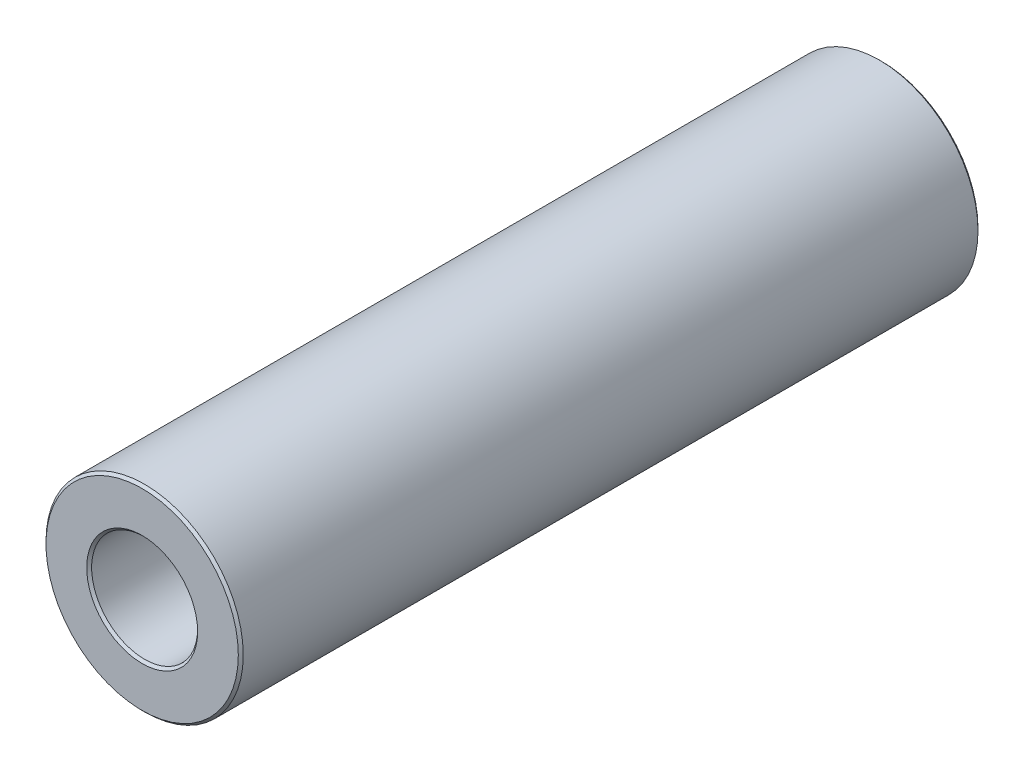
from build123d import *

# Parameters (mm, degrees)
SKETCH1_R           = 4
SKETCH1_R_2         = 2.15
BOSS_EXTRUDE2_DEPTH = 15
CHAMFER3_SIZE       = 0.1


with BuildPart() as part:
    # Sketch1 → Boss-Extrude2 (new, symmetric)
    with BuildSketch(Plane.XY):
        Circle(SKETCH1_R)
        Circle(SKETCH1_R_2, mode=Mode.SUBTRACT)
    extrude(amount=BOSS_EXTRUDE2_DEPTH, both=True)

    # Chamfer3
    chamfer3_edges = [part.edges().sort_by_distance(p)[0] for p in [
        (-4, 0, -15),
        (-4, 0, 15),
        (-2.15, 0, -15),
        (-2.15, 0, 15),
    ]]
    chamfer(chamfer3_edges, length=CHAMFER3_SIZE)


solid = part.part
